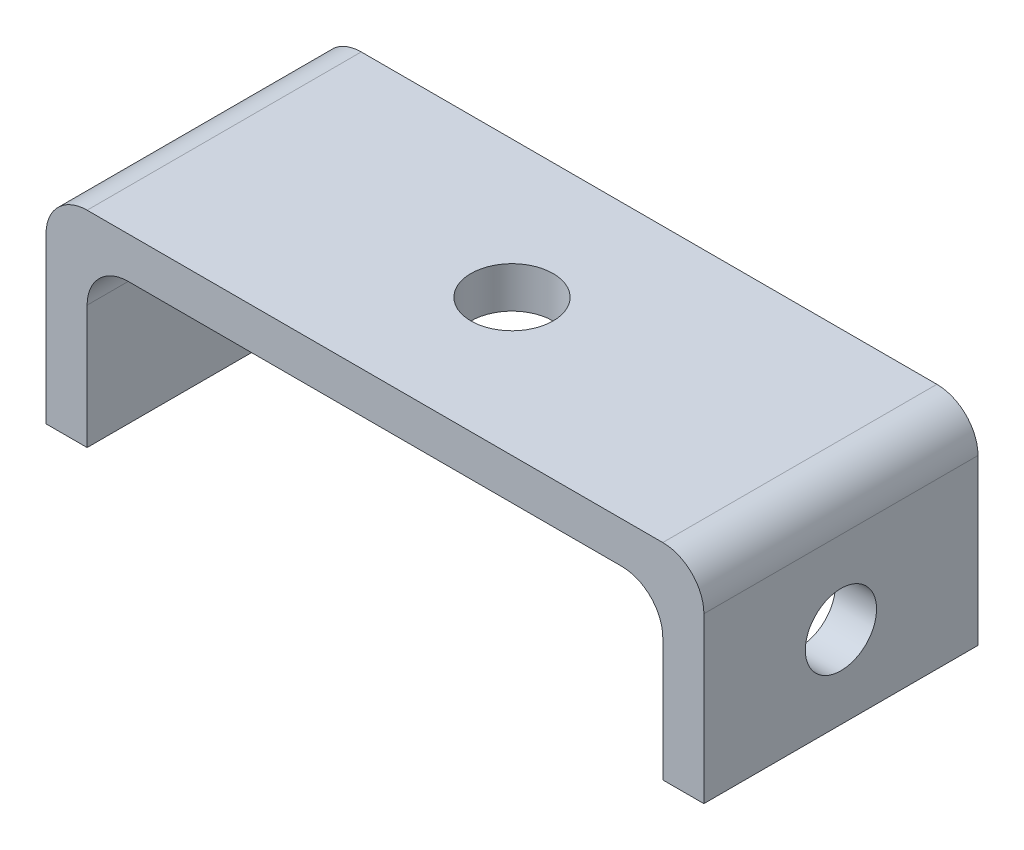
ISO-10303-21;
HEADER;
FILE_DESCRIPTION(('STEP AP214'),'2;1');
FILE_NAME('part.step','',(''),(''),'','','');
FILE_SCHEMA(('AUTOMOTIVE_DESIGN { 1 0 10303 214 1 1 1 1 }'));
ENDSEC;
DATA;
#1=APPLICATION_CONTEXT('core data for automotive mechanical design processes');
#2=APPLICATION_PROTOCOL_DEFINITION('international standard','automotive_design',2000,#1);
#3=PRODUCT_CONTEXT('',#1,'mechanical');
#4=PRODUCT('Part','Part','',(#3));
#5=PRODUCT_RELATED_PRODUCT_CATEGORY('part','',(#4));
#6=PRODUCT_DEFINITION_FORMATION('','',#4);
#7=PRODUCT_DEFINITION_CONTEXT('part definition',#1,'design');
#8=PRODUCT_DEFINITION('design','',#6,#7);
#9=PRODUCT_DEFINITION_SHAPE('','',#8);
#10=(LENGTH_UNIT() NAMED_UNIT(*) SI_UNIT(.MILLI.,.METRE.));
#11=(NAMED_UNIT(*) PLANE_ANGLE_UNIT() SI_UNIT($,.RADIAN.));
#12=(NAMED_UNIT(*) SI_UNIT($,.STERADIAN.) SOLID_ANGLE_UNIT());
#13=UNCERTAINTY_MEASURE_WITH_UNIT(LENGTH_MEASURE(1.E-05),#10,'distance_accuracy_value','');
#14=(GEOMETRIC_REPRESENTATION_CONTEXT(3) GLOBAL_UNCERTAINTY_ASSIGNED_CONTEXT((#13)) GLOBAL_UNIT_ASSIGNED_CONTEXT((#10,
#11,#12)) REPRESENTATION_CONTEXT('',''));
#15=CARTESIAN_POINT('',(0.,0.,0.));
#16=DIRECTION('',(0.,0.,1.));
#17=DIRECTION('',(1.,0.,0.));
#18=AXIS2_PLACEMENT_3D('',#15,#16,#17);
#19=CARTESIAN_POINT('',(-51.8844190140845,14.6482394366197,20.));
#20=DIRECTION('',(1.,0.,0.));
#21=DIRECTION('',(0.,0.,-1.));
#22=AXIS2_PLACEMENT_3D('',#19,#20,#21);
#23=PLANE('',#22);
#24=CARTESIAN_POINT('',(-51.8844190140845,20.6482394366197,10.));
#25=DIRECTION('',(-1.,0.,0.));
#26=DIRECTION('',(0.,0.,1.));
#27=AXIS2_PLACEMENT_3D('',#24,#25,#26);
#28=CIRCLE('',#27,2.6);
#29=CARTESIAN_POINT('',(-51.8844190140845,20.6482394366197,12.6));
#30=VERTEX_POINT('',#29);
#31=EDGE_CURVE('E245',#30,#30,#28,.T.);
#32=ORIENTED_EDGE('',*,*,#31,.F.);
#33=EDGE_LOOP('',(#32));
#34=FACE_BOUND('',#33,.T.);
#35=DIRECTION('',(0.,-1.,0.));
#36=VECTOR('',#35,1.);
#37=CARTESIAN_POINT('',(-51.8844190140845,14.6482394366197,20.));
#38=LINE('',#37,#36);
#39=CARTESIAN_POINT('',(-51.8844190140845,26.6482394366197,20.));
#40=VERTEX_POINT('',#39);
#41=CARTESIAN_POINT('',(-51.8844190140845,14.6482394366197,20.));
#42=VERTEX_POINT('',#41);
#43=EDGE_CURVE('E224',#40,#42,#38,.T.);
#44=ORIENTED_EDGE('',*,*,#43,.F.);
#45=DIRECTION('',(0.,0.,-1.));
#46=VECTOR('',#45,1.);
#47=CARTESIAN_POINT('',(-51.8844190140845,26.6482394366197,20.));
#48=LINE('',#47,#46);
#49=CARTESIAN_POINT('',(-51.8844190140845,26.6482394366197,0.));
#50=VERTEX_POINT('',#49);
#51=EDGE_CURVE('E125',#40,#50,#48,.T.);
#52=ORIENTED_EDGE('',*,*,#51,.T.);
#53=DIRECTION('',(0.,-1.,0.));
#54=VECTOR('',#53,1.);
#55=CARTESIAN_POINT('',(-51.8844190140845,14.6482394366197,0.));
#56=LINE('',#55,#54);
#57=CARTESIAN_POINT('',(-51.8844190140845,14.6482394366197,0.));
#58=VERTEX_POINT('',#57);
#59=EDGE_CURVE('E119',#50,#58,#56,.T.);
#60=ORIENTED_EDGE('',*,*,#59,.T.);
#61=DIRECTION('',(0.,0.,-1.));
#62=VECTOR('',#61,1.);
#63=CARTESIAN_POINT('',(-51.8844190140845,14.6482394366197,20.));
#64=LINE('',#63,#62);
#65=EDGE_CURVE('E123',#42,#58,#64,.T.);
#66=ORIENTED_EDGE('',*,*,#65,.F.);
#67=EDGE_LOOP('',(#44,#52,#60,#66));
#68=FACE_BOUND('',#67,.T.);
#69=ADVANCED_FACE('F29',(#34,#68),#23,.F.);
#70=CARTESIAN_POINT('',(-51.8844190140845,14.6482394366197,20.));
#71=DIRECTION('',(0.,1.,0.));
#72=DIRECTION('',(0.,0.,1.));
#73=AXIS2_PLACEMENT_3D('',#70,#71,#72);
#74=PLANE('',#73);
#75=DIRECTION('',(1.,0.,0.));
#76=VECTOR('',#75,1.);
#77=CARTESIAN_POINT('',(-51.8844190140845,14.6482394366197,0.));
#78=LINE('',#77,#76);
#79=CARTESIAN_POINT('',(-48.8844190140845,14.6482394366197,0.));
#80=VERTEX_POINT('',#79);
#81=EDGE_CURVE('E127',#58,#80,#78,.T.);
#82=ORIENTED_EDGE('',*,*,#81,.T.);
#83=DIRECTION('',(0.,0.,-1.));
#84=VECTOR('',#83,1.);
#85=CARTESIAN_POINT('',(-48.8844190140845,14.6482394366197,20.));
#86=LINE('',#85,#84);
#87=CARTESIAN_POINT('',(-48.8844190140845,14.6482394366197,20.));
#88=VERTEX_POINT('',#87);
#89=EDGE_CURVE('E141',#88,#80,#86,.T.);
#90=ORIENTED_EDGE('',*,*,#89,.F.);
#91=DIRECTION('',(1.,0.,0.));
#92=VECTOR('',#91,1.);
#93=CARTESIAN_POINT('',(-51.8844190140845,14.6482394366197,20.));
#94=LINE('',#93,#92);
#95=EDGE_CURVE('E140',#42,#88,#94,.T.);
#96=ORIENTED_EDGE('',*,*,#95,.F.);
#97=ORIENTED_EDGE('',*,*,#65,.T.);
#98=EDGE_LOOP('',(#82,#90,#96,#97));
#99=FACE_BOUND('',#98,.T.);
#100=ADVANCED_FACE('F139',(#99),#74,.F.);
#101=CARTESIAN_POINT('',(-48.8844190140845,26.6482394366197,20.));
#102=DIRECTION('',(-1.,0.,0.));
#103=DIRECTION('',(0.,-1.,0.));
#104=AXIS2_PLACEMENT_3D('',#101,#102,#103);
#105=PLANE('',#104);
#106=CARTESIAN_POINT('',(-48.8844190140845,20.6482394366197,10.));
#107=DIRECTION('',(-1.,0.,0.));
#108=DIRECTION('',(0.,-1.,0.));
#109=AXIS2_PLACEMENT_3D('',#106,#107,#108);
#110=CIRCLE('',#109,2.6);
#111=CARTESIAN_POINT('',(-48.8844190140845,18.0482394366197,10.));
#112=VERTEX_POINT('',#111);
#113=EDGE_CURVE('E128',#112,#112,#110,.T.);
#114=ORIENTED_EDGE('',*,*,#113,.T.);
#115=EDGE_LOOP('',(#114));
#116=FACE_BOUND('',#115,.T.);
#117=DIRECTION('',(0.,1.,0.));
#118=VECTOR('',#117,1.);
#119=CARTESIAN_POINT('',(-48.8844190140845,26.6482394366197,0.));
#120=LINE('',#119,#118);
#121=CARTESIAN_POINT('',(-48.8844190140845,23.6482394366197,0.));
#122=VERTEX_POINT('',#121);
#123=EDGE_CURVE('E133',#80,#122,#120,.T.);
#124=ORIENTED_EDGE('',*,*,#123,.T.);
#125=DIRECTION('',(0.,0.,-1.));
#126=VECTOR('',#125,1.);
#127=CARTESIAN_POINT('',(-48.8844190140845,23.6482394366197,20.));
#128=LINE('',#127,#126);
#129=CARTESIAN_POINT('',(-48.8844190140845,23.6482394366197,20.));
#130=VERTEX_POINT('',#129);
#131=EDGE_CURVE('E167',#122,#130,#128,.F.);
#132=ORIENTED_EDGE('',*,*,#131,.T.);
#133=DIRECTION('',(0.,1.,0.));
#134=VECTOR('',#133,1.);
#135=CARTESIAN_POINT('',(-48.8844190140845,26.6482394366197,20.));
#136=LINE('',#135,#134);
#137=EDGE_CURVE('E201',#88,#130,#136,.T.);
#138=ORIENTED_EDGE('',*,*,#137,.F.);
#139=ORIENTED_EDGE('',*,*,#89,.T.);
#140=EDGE_LOOP('',(#124,#132,#138,#139));
#141=FACE_BOUND('',#140,.T.);
#142=ADVANCED_FACE('F234',(#116,#141),#105,.F.);
#143=CARTESIAN_POINT('',(-48.8844190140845,26.6482394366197,20.));
#144=DIRECTION('',(0.,1.,0.));
#145=DIRECTION('',(0.,0.,1.));
#146=AXIS2_PLACEMENT_3D('',#143,#144,#145);
#147=PLANE('',#146);
#148=CARTESIAN_POINT('',(-27.8844190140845,26.6482394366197,10.));
#149=DIRECTION('',(0.,-1.,0.));
#150=DIRECTION('',(0.,0.,-1.));
#151=AXIS2_PLACEMENT_3D('',#148,#149,#150);
#152=CIRCLE('',#151,3.);
#153=CARTESIAN_POINT('',(-27.8844190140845,26.6482394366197,7.));
#154=VERTEX_POINT('',#153);
#155=EDGE_CURVE('E251',#154,#154,#152,.T.);
#156=ORIENTED_EDGE('',*,*,#155,.F.);
#157=EDGE_LOOP('',(#156));
#158=FACE_BOUND('',#157,.T.);
#159=DIRECTION('',(1.,0.,0.));
#160=VECTOR('',#159,1.);
#161=CARTESIAN_POINT('',(-48.8844190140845,26.6482394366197,20.));
#162=LINE('',#161,#160);
#163=CARTESIAN_POINT('',(-45.8844190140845,26.6482394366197,20.));
#164=VERTEX_POINT('',#163);
#165=CARTESIAN_POINT('',(-9.8844190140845,26.6482394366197,20.));
#166=VERTEX_POINT('',#165);
#167=EDGE_CURVE('E197',#164,#166,#162,.T.);
#168=ORIENTED_EDGE('',*,*,#167,.F.);
#169=DIRECTION('',(0.,0.,-1.));
#170=VECTOR('',#169,1.);
#171=CARTESIAN_POINT('',(-45.8844190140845,26.6482394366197,0.));
#172=LINE('',#171,#170);
#173=CARTESIAN_POINT('',(-45.8844190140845,26.6482394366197,0.));
#174=VERTEX_POINT('',#173);
#175=EDGE_CURVE('E164',#164,#174,#172,.T.);
#176=ORIENTED_EDGE('',*,*,#175,.T.);
#177=DIRECTION('',(1.,0.,0.));
#178=VECTOR('',#177,1.);
#179=CARTESIAN_POINT('',(-48.8844190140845,26.6482394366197,0.));
#180=LINE('',#179,#178);
#181=CARTESIAN_POINT('',(-9.8844190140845,26.6482394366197,0.));
#182=VERTEX_POINT('',#181);
#183=EDGE_CURVE('E178',#174,#182,#180,.T.);
#184=ORIENTED_EDGE('',*,*,#183,.T.);
#185=DIRECTION('',(0.,0.,-1.));
#186=VECTOR('',#185,1.);
#187=CARTESIAN_POINT('',(-9.88441901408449,26.6482394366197,20.));
#188=LINE('',#187,#186);
#189=EDGE_CURVE('E162',#182,#166,#188,.F.);
#190=ORIENTED_EDGE('',*,*,#189,.T.);
#191=EDGE_LOOP('',(#168,#176,#184,#190));
#192=FACE_BOUND('',#191,.T.);
#193=ADVANCED_FACE('F186',(#158,#192),#147,.F.);
#194=CARTESIAN_POINT('',(-6.88441901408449,26.6482394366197,20.));
#195=DIRECTION('',(1.,0.,0.));
#196=DIRECTION('',(0.,1.,0.));
#197=AXIS2_PLACEMENT_3D('',#194,#195,#196);
#198=PLANE('',#197);
#199=CARTESIAN_POINT('',(-6.88441901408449,20.6482394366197,10.));
#200=DIRECTION('',(1.,0.,0.));
#201=DIRECTION('',(0.,1.,0.));
#202=AXIS2_PLACEMENT_3D('',#199,#200,#201);
#203=CIRCLE('',#202,2.6);
#204=CARTESIAN_POINT('',(-6.88441901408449,23.2482394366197,10.));
#205=VERTEX_POINT('',#204);
#206=EDGE_CURVE('E239',#205,#205,#203,.T.);
#207=ORIENTED_EDGE('',*,*,#206,.T.);
#208=EDGE_LOOP('',(#207));
#209=FACE_BOUND('',#208,.T.);
#210=DIRECTION('',(0.,-1.,0.));
#211=VECTOR('',#210,1.);
#212=CARTESIAN_POINT('',(-6.88441901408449,26.6482394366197,20.));
#213=LINE('',#212,#211);
#214=CARTESIAN_POINT('',(-6.88441901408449,23.6482394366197,20.));
#215=VERTEX_POINT('',#214);
#216=CARTESIAN_POINT('',(-6.88441901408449,14.6482394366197,20.));
#217=VERTEX_POINT('',#216);
#218=EDGE_CURVE('E194',#215,#217,#213,.T.);
#219=ORIENTED_EDGE('',*,*,#218,.F.);
#220=DIRECTION('',(0.,0.,-1.));
#221=VECTOR('',#220,1.);
#222=CARTESIAN_POINT('',(-6.88441901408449,23.6482394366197,0.));
#223=LINE('',#222,#221);
#224=CARTESIAN_POINT('',(-6.88441901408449,23.6482394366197,0.));
#225=VERTEX_POINT('',#224);
#226=EDGE_CURVE('E169',#215,#225,#223,.T.);
#227=ORIENTED_EDGE('',*,*,#226,.T.);
#228=DIRECTION('',(0.,-1.,0.));
#229=VECTOR('',#228,1.);
#230=CARTESIAN_POINT('',(-6.88441901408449,26.6482394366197,0.));
#231=LINE('',#230,#229);
#232=CARTESIAN_POINT('',(-6.88441901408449,14.6482394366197,0.));
#233=VERTEX_POINT('',#232);
#234=EDGE_CURVE('E180',#225,#233,#231,.T.);
#235=ORIENTED_EDGE('',*,*,#234,.T.);
#236=DIRECTION('',(0.,0.,-1.));
#237=VECTOR('',#236,1.);
#238=CARTESIAN_POINT('',(-6.88441901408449,14.6482394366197,20.));
#239=LINE('',#238,#237);
#240=EDGE_CURVE('E145',#217,#233,#239,.T.);
#241=ORIENTED_EDGE('',*,*,#240,.F.);
#242=EDGE_LOOP('',(#219,#227,#235,#241));
#243=FACE_BOUND('',#242,.T.);
#244=ADVANCED_FACE('F191',(#209,#243),#198,.F.);
#245=CARTESIAN_POINT('',(-3.8844190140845,14.6482394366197,20.));
#246=DIRECTION('',(0.,1.,0.));
#247=DIRECTION('',(-1.,0.,0.));
#248=AXIS2_PLACEMENT_3D('',#245,#246,#247);
#249=PLANE('',#248);
#250=DIRECTION('',(1.,0.,0.));
#251=VECTOR('',#250,1.);
#252=CARTESIAN_POINT('',(-3.8844190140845,14.6482394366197,0.));
#253=LINE('',#252,#251);
#254=CARTESIAN_POINT('',(-3.8844190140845,14.6482394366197,0.));
#255=VERTEX_POINT('',#254);
#256=EDGE_CURVE('E214',#233,#255,#253,.T.);
#257=ORIENTED_EDGE('',*,*,#256,.T.);
#258=DIRECTION('',(0.,0.,-1.));
#259=VECTOR('',#258,1.);
#260=CARTESIAN_POINT('',(-3.8844190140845,14.6482394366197,20.));
#261=LINE('',#260,#259);
#262=CARTESIAN_POINT('',(-3.8844190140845,14.6482394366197,20.));
#263=VERTEX_POINT('',#262);
#264=EDGE_CURVE('E209',#263,#255,#261,.T.);
#265=ORIENTED_EDGE('',*,*,#264,.F.);
#266=DIRECTION('',(1.,0.,0.));
#267=VECTOR('',#266,1.);
#268=CARTESIAN_POINT('',(-3.8844190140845,14.6482394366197,20.));
#269=LINE('',#268,#267);
#270=EDGE_CURVE('E196',#217,#263,#269,.T.);
#271=ORIENTED_EDGE('',*,*,#270,.F.);
#272=ORIENTED_EDGE('',*,*,#240,.T.);
#273=EDGE_LOOP('',(#257,#265,#271,#272));
#274=FACE_BOUND('',#273,.T.);
#275=ADVANCED_FACE('F212',(#274),#249,.F.);
#276=CARTESIAN_POINT('',(-3.8844190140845,29.6482394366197,20.));
#277=DIRECTION('',(-1.,0.,0.));
#278=DIRECTION('',(0.,-1.,0.));
#279=AXIS2_PLACEMENT_3D('',#276,#277,#278);
#280=PLANE('',#279);
#281=CARTESIAN_POINT('',(-3.8844190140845,20.6482394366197,10.));
#282=DIRECTION('',(-1.,0.,0.));
#283=DIRECTION('',(0.,0.,1.));
#284=AXIS2_PLACEMENT_3D('',#281,#282,#283);
#285=CIRCLE('',#284,2.6);
#286=CARTESIAN_POINT('',(-3.8844190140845,20.6482394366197,12.6));
#287=VERTEX_POINT('',#286);
#288=EDGE_CURVE('E242',#287,#287,#285,.T.);
#289=ORIENTED_EDGE('',*,*,#288,.T.);
#290=EDGE_LOOP('',(#289));
#291=FACE_BOUND('',#290,.T.);
#292=DIRECTION('',(0.,1.,0.));
#293=VECTOR('',#292,1.);
#294=CARTESIAN_POINT('',(-3.8844190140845,29.6482394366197,0.));
#295=LINE('',#294,#293);
#296=CARTESIAN_POINT('',(-3.8844190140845,26.6482394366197,0.));
#297=VERTEX_POINT('',#296);
#298=EDGE_CURVE('E216',#255,#297,#295,.T.);
#299=ORIENTED_EDGE('',*,*,#298,.T.);
#300=DIRECTION('',(0.,0.,-1.));
#301=VECTOR('',#300,1.);
#302=CARTESIAN_POINT('',(-3.8844190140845,26.6482394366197,20.));
#303=LINE('',#302,#301);
#304=CARTESIAN_POINT('',(-3.8844190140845,26.6482394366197,20.));
#305=VERTEX_POINT('',#304);
#306=EDGE_CURVE('E43',#297,#305,#303,.F.);
#307=ORIENTED_EDGE('',*,*,#306,.T.);
#308=DIRECTION('',(0.,1.,0.));
#309=VECTOR('',#308,1.);
#310=CARTESIAN_POINT('',(-3.8844190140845,29.6482394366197,20.));
#311=LINE('',#310,#309);
#312=EDGE_CURVE('E199',#263,#305,#311,.T.);
#313=ORIENTED_EDGE('',*,*,#312,.F.);
#314=ORIENTED_EDGE('',*,*,#264,.T.);
#315=EDGE_LOOP('',(#299,#307,#313,#314));
#316=FACE_BOUND('',#315,.T.);
#317=ADVANCED_FACE('F307',(#291,#316),#280,.F.);
#318=CARTESIAN_POINT('',(-51.8844190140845,29.6482394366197,20.));
#319=DIRECTION('',(0.,-1.,0.));
#320=DIRECTION('',(0.,0.,-1.));
#321=AXIS2_PLACEMENT_3D('',#318,#319,#320);
#322=PLANE('',#321);
#323=CARTESIAN_POINT('',(-27.8844190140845,29.6482394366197,10.));
#324=DIRECTION('',(0.,-1.,0.));
#325=DIRECTION('',(0.,0.,-1.));
#326=AXIS2_PLACEMENT_3D('',#323,#324,#325);
#327=CIRCLE('',#326,3.);
#328=CARTESIAN_POINT('',(-27.8844190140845,29.6482394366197,7.));
#329=VERTEX_POINT('',#328);
#330=EDGE_CURVE('E248',#329,#329,#327,.T.);
#331=ORIENTED_EDGE('',*,*,#330,.T.);
#332=EDGE_LOOP('',(#331));
#333=FACE_BOUND('',#332,.T.);
#334=DIRECTION('',(-1.,0.,0.));
#335=VECTOR('',#334,1.);
#336=CARTESIAN_POINT('',(-51.8844190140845,29.6482394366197,0.));
#337=LINE('',#336,#335);
#338=CARTESIAN_POINT('',(-6.8844190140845,29.6482394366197,0.));
#339=VERTEX_POINT('',#338);
#340=CARTESIAN_POINT('',(-48.8844190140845,29.6482394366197,0.));
#341=VERTEX_POINT('',#340);
#342=EDGE_CURVE('E218',#339,#341,#337,.T.);
#343=ORIENTED_EDGE('',*,*,#342,.T.);
#344=DIRECTION('',(0.,0.,-1.));
#345=VECTOR('',#344,1.);
#346=CARTESIAN_POINT('',(-48.8844190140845,29.6482394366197,20.));
#347=LINE('',#346,#345);
#348=CARTESIAN_POINT('',(-48.8844190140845,29.6482394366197,20.));
#349=VERTEX_POINT('',#348);
#350=EDGE_CURVE('E155',#341,#349,#347,.F.);
#351=ORIENTED_EDGE('',*,*,#350,.T.);
#352=DIRECTION('',(-1.,0.,0.));
#353=VECTOR('',#352,1.);
#354=CARTESIAN_POINT('',(-51.8844190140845,29.6482394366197,20.));
#355=LINE('',#354,#353);
#356=CARTESIAN_POINT('',(-6.8844190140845,29.6482394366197,20.));
#357=VERTEX_POINT('',#356);
#358=EDGE_CURVE('E206',#357,#349,#355,.T.);
#359=ORIENTED_EDGE('',*,*,#358,.F.);
#360=DIRECTION('',(0.,0.,-1.));
#361=VECTOR('',#360,1.);
#362=CARTESIAN_POINT('',(-6.8844190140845,29.6482394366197,20.));
#363=LINE('',#362,#361);
#364=EDGE_CURVE('E152',#357,#339,#363,.T.);
#365=ORIENTED_EDGE('',*,*,#364,.T.);
#366=EDGE_LOOP('',(#343,#351,#359,#365));
#367=FACE_BOUND('',#366,.T.);
#368=ADVANCED_FACE('F305',(#333,#367),#322,.F.);
#369=CARTESIAN_POINT('',(-51.8844190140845,29.6482394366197,20.));
#370=DIRECTION('',(0.,0.,-1.));
#371=DIRECTION('',(-1.,0.,0.));
#372=AXIS2_PLACEMENT_3D('',#369,#370,#371);
#373=PLANE('',#372);
#374=ORIENTED_EDGE('',*,*,#358,.T.);
#375=CARTESIAN_POINT('',(-48.8844190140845,26.6482394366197,20.));
#376=DIRECTION('',(0.,0.,-1.));
#377=DIRECTION('',(-1.,0.,0.));
#378=AXIS2_PLACEMENT_3D('',#375,#376,#377);
#379=CIRCLE('',#378,3.);
#380=EDGE_CURVE('E159',#349,#40,#379,.F.);
#381=ORIENTED_EDGE('',*,*,#380,.T.);
#382=ORIENTED_EDGE('',*,*,#43,.T.);
#383=ORIENTED_EDGE('',*,*,#95,.T.);
#384=ORIENTED_EDGE('',*,*,#137,.T.);
#385=CARTESIAN_POINT('',(-45.8844190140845,23.6482394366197,20.));
#386=DIRECTION('',(0.,0.,-1.));
#387=DIRECTION('',(-1.,0.,0.));
#388=AXIS2_PLACEMENT_3D('',#385,#386,#387);
#389=CIRCLE('',#388,3.);
#390=EDGE_CURVE('E174',#130,#164,#389,.T.);
#391=ORIENTED_EDGE('',*,*,#390,.T.);
#392=ORIENTED_EDGE('',*,*,#167,.T.);
#393=CARTESIAN_POINT('',(-9.88441901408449,23.6482394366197,20.));
#394=DIRECTION('',(0.,0.,-1.));
#395=DIRECTION('',(-1.,0.,0.));
#396=AXIS2_PLACEMENT_3D('',#393,#394,#395);
#397=CIRCLE('',#396,3.);
#398=EDGE_CURVE('E11',#166,#215,#397,.T.);
#399=ORIENTED_EDGE('',*,*,#398,.T.);
#400=ORIENTED_EDGE('',*,*,#218,.T.);
#401=ORIENTED_EDGE('',*,*,#270,.T.);
#402=ORIENTED_EDGE('',*,*,#312,.T.);
#403=CARTESIAN_POINT('',(-6.8844190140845,26.6482394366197,20.));
#404=DIRECTION('',(0.,0.,-1.));
#405=DIRECTION('',(-1.,0.,0.));
#406=AXIS2_PLACEMENT_3D('',#403,#404,#405);
#407=CIRCLE('',#406,3.);
#408=EDGE_CURVE('E157',#305,#357,#407,.F.);
#409=ORIENTED_EDGE('',*,*,#408,.T.);
#410=EDGE_LOOP('',(#374,#381,#382,#383,#384,#391,#392,#399,#400,#401,#402,#409));
#411=FACE_BOUND('',#410,.T.);
#412=ADVANCED_FACE('F229',(#411),#373,.F.);
#413=CARTESIAN_POINT('',(-51.8844190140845,29.6482394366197,0.));
#414=DIRECTION('',(0.,0.,-1.));
#415=DIRECTION('',(-1.,0.,0.));
#416=AXIS2_PLACEMENT_3D('',#413,#414,#415);
#417=PLANE('',#416);
#418=ORIENTED_EDGE('',*,*,#59,.F.);
#419=CARTESIAN_POINT('',(-48.8844190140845,26.6482394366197,0.));
#420=DIRECTION('',(0.,0.,-1.));
#421=DIRECTION('',(-1.,0.,0.));
#422=AXIS2_PLACEMENT_3D('',#419,#420,#421);
#423=CIRCLE('',#422,3.);
#424=EDGE_CURVE('E150',#50,#341,#423,.T.);
#425=ORIENTED_EDGE('',*,*,#424,.T.);
#426=ORIENTED_EDGE('',*,*,#342,.F.);
#427=CARTESIAN_POINT('',(-6.8844190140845,26.6482394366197,0.));
#428=DIRECTION('',(0.,0.,-1.));
#429=DIRECTION('',(-1.,0.,0.));
#430=AXIS2_PLACEMENT_3D('',#427,#428,#429);
#431=CIRCLE('',#430,3.);
#432=EDGE_CURVE('E143',#339,#297,#431,.T.);
#433=ORIENTED_EDGE('',*,*,#432,.T.);
#434=ORIENTED_EDGE('',*,*,#298,.F.);
#435=ORIENTED_EDGE('',*,*,#256,.F.);
#436=ORIENTED_EDGE('',*,*,#234,.F.);
#437=CARTESIAN_POINT('',(-9.88441901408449,23.6482394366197,0.));
#438=DIRECTION('',(0.,0.,-1.));
#439=DIRECTION('',(-1.,0.,0.));
#440=AXIS2_PLACEMENT_3D('',#437,#438,#439);
#441=CIRCLE('',#440,3.);
#442=EDGE_CURVE('E36',#225,#182,#441,.F.);
#443=ORIENTED_EDGE('',*,*,#442,.T.);
#444=ORIENTED_EDGE('',*,*,#183,.F.);
#445=CARTESIAN_POINT('',(-45.8844190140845,23.6482394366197,0.));
#446=DIRECTION('',(0.,0.,-1.));
#447=DIRECTION('',(-1.,0.,0.));
#448=AXIS2_PLACEMENT_3D('',#445,#446,#447);
#449=CIRCLE('',#448,3.);
#450=EDGE_CURVE('E172',#174,#122,#449,.F.);
#451=ORIENTED_EDGE('',*,*,#450,.T.);
#452=ORIENTED_EDGE('',*,*,#123,.F.);
#453=ORIENTED_EDGE('',*,*,#81,.F.);
#454=EDGE_LOOP('',(#418,#425,#426,#433,#434,#435,#436,#443,#444,#451,#452,#453));
#455=FACE_BOUND('',#454,.T.);
#456=ADVANCED_FACE('F131',(#455),#417,.T.);
#457=CARTESIAN_POINT('',(-48.8844190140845,26.6482394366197,20.));
#458=DIRECTION('',(0.,0.,-1.));
#459=DIRECTION('',(-1.,0.,0.));
#460=AXIS2_PLACEMENT_3D('',#457,#458,#459);
#461=CYLINDRICAL_SURFACE('',#460,3.);
#462=ORIENTED_EDGE('',*,*,#380,.F.);
#463=ORIENTED_EDGE('',*,*,#350,.F.);
#464=ORIENTED_EDGE('',*,*,#424,.F.);
#465=ORIENTED_EDGE('',*,*,#51,.F.);
#466=EDGE_LOOP('',(#462,#463,#464,#465));
#467=FACE_BOUND('',#466,.T.);
#468=ADVANCED_FACE('F296',(#467),#461,.T.);
#469=CARTESIAN_POINT('',(-6.8844190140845,26.6482394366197,20.));
#470=DIRECTION('',(0.,0.,-1.));
#471=DIRECTION('',(-1.,0.,0.));
#472=AXIS2_PLACEMENT_3D('',#469,#470,#471);
#473=CYLINDRICAL_SURFACE('',#472,3.);
#474=ORIENTED_EDGE('',*,*,#408,.F.);
#475=ORIENTED_EDGE('',*,*,#306,.F.);
#476=ORIENTED_EDGE('',*,*,#432,.F.);
#477=ORIENTED_EDGE('',*,*,#364,.F.);
#478=EDGE_LOOP('',(#474,#475,#476,#477));
#479=FACE_BOUND('',#478,.T.);
#480=ADVANCED_FACE('F293',(#479),#473,.T.);
#481=CARTESIAN_POINT('',(-45.8844190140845,23.6482394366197,20.));
#482=DIRECTION('',(0.,0.,1.));
#483=DIRECTION('',(1.,0.,0.));
#484=AXIS2_PLACEMENT_3D('',#481,#482,#483);
#485=CYLINDRICAL_SURFACE('',#484,3.);
#486=ORIENTED_EDGE('',*,*,#390,.F.);
#487=ORIENTED_EDGE('',*,*,#131,.F.);
#488=ORIENTED_EDGE('',*,*,#450,.F.);
#489=ORIENTED_EDGE('',*,*,#175,.F.);
#490=EDGE_LOOP('',(#486,#487,#488,#489));
#491=FACE_BOUND('',#490,.T.);
#492=ADVANCED_FACE('F233',(#491),#485,.F.);
#493=CARTESIAN_POINT('',(-9.88441901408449,23.6482394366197,20.));
#494=DIRECTION('',(0.,0.,1.));
#495=DIRECTION('',(1.,0.,0.));
#496=AXIS2_PLACEMENT_3D('',#493,#494,#495);
#497=CYLINDRICAL_SURFACE('',#496,3.);
#498=ORIENTED_EDGE('',*,*,#398,.F.);
#499=ORIENTED_EDGE('',*,*,#189,.F.);
#500=ORIENTED_EDGE('',*,*,#442,.F.);
#501=ORIENTED_EDGE('',*,*,#226,.F.);
#502=EDGE_LOOP('',(#498,#499,#500,#501));
#503=FACE_BOUND('',#502,.T.);
#504=ADVANCED_FACE('F189',(#503),#497,.F.);
#505=CARTESIAN_POINT('',(-3.8844190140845,20.6482394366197,10.));
#506=DIRECTION('',(-1.,0.,0.));
#507=DIRECTION('',(0.,0.,1.));
#508=AXIS2_PLACEMENT_3D('',#505,#506,#507);
#509=CYLINDRICAL_SURFACE('',#508,2.6);
#510=ORIENTED_EDGE('',*,*,#288,.F.);
#511=EDGE_LOOP('',(#510));
#512=FACE_BOUND('',#511,.T.);
#513=ORIENTED_EDGE('',*,*,#206,.F.);
#514=EDGE_LOOP('',(#513));
#515=FACE_BOUND('',#514,.T.);
#516=ADVANCED_FACE('F279',(#512,#515),#509,.F.);
#517=ORIENTED_EDGE('',*,*,#31,.T.);
#518=EDGE_LOOP('',(#517));
#519=FACE_BOUND('',#518,.T.);
#520=ORIENTED_EDGE('',*,*,#113,.F.);
#521=EDGE_LOOP('',(#520));
#522=FACE_BOUND('',#521,.T.);
#523=ADVANCED_FACE('F277',(#519,#522),#509,.F.);
#524=CARTESIAN_POINT('',(-27.8844190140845,29.6482394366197,10.));
#525=DIRECTION('',(0.,-1.,0.));
#526=DIRECTION('',(0.,0.,-1.));
#527=AXIS2_PLACEMENT_3D('',#524,#525,#526);
#528=CYLINDRICAL_SURFACE('',#527,3.);
#529=ORIENTED_EDGE('',*,*,#330,.F.);
#530=EDGE_LOOP('',(#529));
#531=FACE_BOUND('',#530,.T.);
#532=ORIENTED_EDGE('',*,*,#155,.T.);
#533=EDGE_LOOP('',(#532));
#534=FACE_BOUND('',#533,.T.);
#535=ADVANCED_FACE('F255',(#531,#534),#528,.F.);
#536=CLOSED_SHELL('',(#69,#100,#142,#193,#244,#275,#317,#368,#412,#456,#468,#480,#492,#504,#516,
#523,#535));
#537=MANIFOLD_SOLID_BREP('B2',#536);
#538=ADVANCED_BREP_SHAPE_REPRESENTATION('',(#18,#537),#14);
#539=SHAPE_DEFINITION_REPRESENTATION(#9,#538);
ENDSEC;
END-ISO-10303-21;
